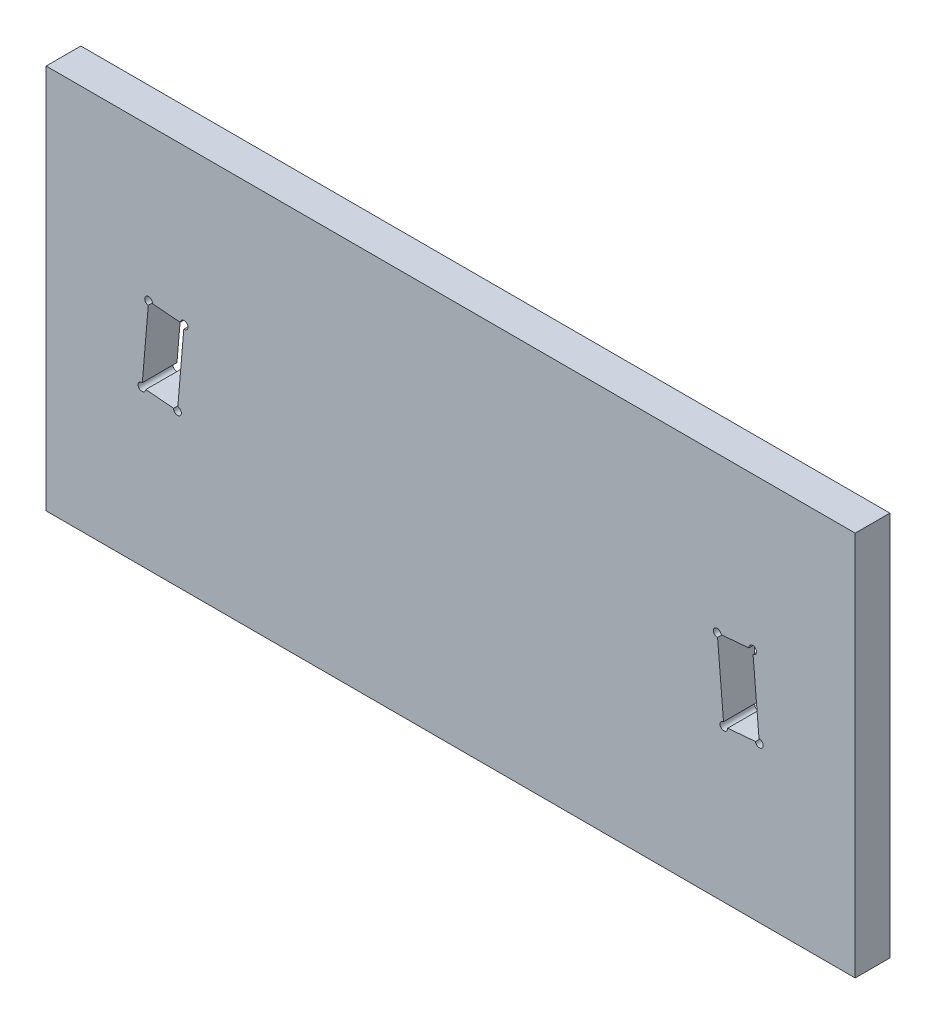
from build123d import *

# Parameters (mm, degrees)
SKETCH1_W           = 420
SKETCH1_H           = 200
BOSS_EXTRUDE1_DEPTH = 18
CUT_EXTRUDE1_REACH  = 565.99
SKETCH2_R           = 2


with BuildPart() as part:
    # Sketch1 → Boss-Extrude1 (new body)
    with BuildSketch(Plane.XY):
        with Locations((-18.576599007, 415.279657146)):
            Rectangle(SKETCH1_W, SKETCH1_H)
        Polygon((119.801256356, 434.672073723), (138.234584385, 436.241283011), (141.669880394, 395.88724057), (123.236552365, 394.318031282), align=None, mode=Mode.SUBTRACT)
        Polygon((-160.38975038, 394.318031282), (-156.954454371, 434.672073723), (-175.387782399, 436.241283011), (-178.823078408, 395.88724057), align=None, mode=Mode.SUBTRACT)
    extrude(amount=BOSS_EXTRUDE1_DEPTH)

    # Sketch2 → Cut-Extrude1 (cut, up to next)
    with BuildSketch(Plane.XY.offset(18), mode=Mode.PRIVATE) as cut_extrude1_sk1:
        with Locations((138.234584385, 436.241283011)):
            Circle(SKETCH2_R)
    cut_extrude1_tool1 = extrude(cut_extrude1_sk1.sketch, amount=-CUT_EXTRUDE1_REACH, mode=Mode.PRIVATE) & part.part
    # Sketch2 → Cut-Extrude1 (cut, up to next)
    with BuildSketch(Plane.XY.offset(18), mode=Mode.PRIVATE) as cut_extrude1_sk2:
        with Locations((119.801256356, 434.672073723)):
            Circle(SKETCH2_R)
    cut_extrude1_tool2 = extrude(cut_extrude1_sk2.sketch, amount=-CUT_EXTRUDE1_REACH, mode=Mode.PRIVATE) & part.part
    # Sketch2 → Cut-Extrude1 (cut, up to next)
    with BuildSketch(Plane.XY.offset(18), mode=Mode.PRIVATE) as cut_extrude1_sk3:
        with Locations((141.669880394, 395.88724057)):
            Circle(SKETCH2_R)
    cut_extrude1_tool3 = extrude(cut_extrude1_sk3.sketch, amount=-CUT_EXTRUDE1_REACH, mode=Mode.PRIVATE) & part.part
    # Sketch2 → Cut-Extrude1 (cut, up to next)
    with BuildSketch(Plane.XY.offset(18), mode=Mode.PRIVATE) as cut_extrude1_sk4:
        with Locations((123.236552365, 394.318031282)):
            Circle(SKETCH2_R)
    cut_extrude1_tool4 = extrude(cut_extrude1_sk4.sketch, amount=-CUT_EXTRUDE1_REACH, mode=Mode.PRIVATE) & part.part
    # Sketch2 → Cut-Extrude1 (cut, up to next)
    with BuildSketch(Plane.XY.offset(18), mode=Mode.PRIVATE) as cut_extrude1_sk5:
        with Locations((-156.954454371, 434.672073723)):
            Circle(SKETCH2_R)
    cut_extrude1_tool5 = extrude(cut_extrude1_sk5.sketch, amount=-CUT_EXTRUDE1_REACH, mode=Mode.PRIVATE) & part.part
    # Sketch2 → Cut-Extrude1 (cut, up to next)
    with BuildSketch(Plane.XY.offset(18), mode=Mode.PRIVATE) as cut_extrude1_sk6:
        with Locations((-160.38975038, 394.318031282)):
            Circle(SKETCH2_R)
    cut_extrude1_tool6 = extrude(cut_extrude1_sk6.sketch, amount=-CUT_EXTRUDE1_REACH, mode=Mode.PRIVATE) & part.part
    # Sketch2 → Cut-Extrude1 (cut, up to next)
    with BuildSketch(Plane.XY.offset(18), mode=Mode.PRIVATE) as cut_extrude1_sk7:
        with Locations((-175.387782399, 436.241283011)):
            Circle(SKETCH2_R)
    cut_extrude1_tool7 = extrude(cut_extrude1_sk7.sketch, amount=-CUT_EXTRUDE1_REACH, mode=Mode.PRIVATE) & part.part
    # Sketch2 → Cut-Extrude1 (cut, up to next)
    with BuildSketch(Plane.XY.offset(18), mode=Mode.PRIVATE) as cut_extrude1_sk8:
        with Locations((-178.823078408, 395.88724057)):
            Circle(SKETCH2_R)
    cut_extrude1_tool8 = extrude(cut_extrude1_sk8.sketch, amount=-CUT_EXTRUDE1_REACH, mode=Mode.PRIVATE) & part.part
    add(cut_extrude1_tool1.solids().sort_by_distance((138.234584, 436.241283, 18))[0], mode=Mode.SUBTRACT)
    add(cut_extrude1_tool2.solids().sort_by_distance((119.801256, 434.672074, 18))[0], mode=Mode.SUBTRACT)
    add(cut_extrude1_tool3.solids().sort_by_distance((141.66988, 395.887241, 18))[0], mode=Mode.SUBTRACT)
    add(cut_extrude1_tool4.solids().sort_by_distance((123.236552, 394.318031, 18))[0], mode=Mode.SUBTRACT)
    add(cut_extrude1_tool5.solids().sort_by_distance((-156.954454, 434.672074, 18))[0], mode=Mode.SUBTRACT)
    add(cut_extrude1_tool6.solids().sort_by_distance((-160.38975, 394.318031, 18))[0], mode=Mode.SUBTRACT)
    add(cut_extrude1_tool7.solids().sort_by_distance((-175.387782, 436.241283, 18))[0], mode=Mode.SUBTRACT)
    add(cut_extrude1_tool8.solids().sort_by_distance((-178.823078, 395.887241, 18))[0], mode=Mode.SUBTRACT)


solid = part.part
